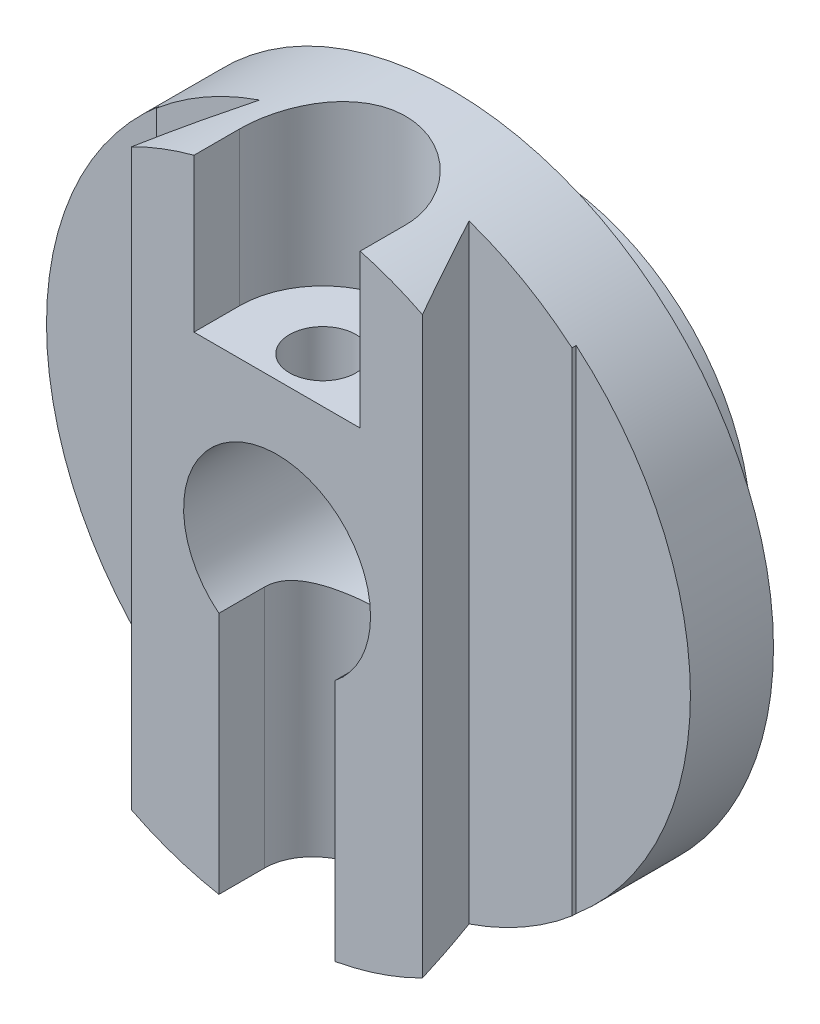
from build123d import *

# Parameters (mm, degrees)
SKETCH1_R           = 77.5
BOSS_EXTRUDE1_DEPTH = 64
SKETCH2_W           = 27.5
SKETCH2_H           = 22
CUT_EXTRUDE1_DEPTH  = 100
SKETCH3_W           = 100
SKETCH3_H           = 22
CUT_EXTRUDE2_DEPTH  = 100
SKETCH4_R           = 50
BOSS_EXTRUDE2_DEPTH = 22
HOLE1_D             = 22
HOLE1_CBORE_D       = 45
HOLE1_CBORE_DEPTH   = 42
CUT_EXTRUDE3_DEPTH  = 39.5
CUT_EXTRUDE4_START  = -77.5
CUT_EXTRUDE4_DEPTH  = 77.5
SKETCH10_R          = 8
CUT_EXTRUDE6_DEPTH  = 150


with BuildPart() as part:
    # Sketch1 → Boss-Extrude1 (new body)
    with BuildSketch(Plane.XY):
        Circle(SKETCH1_R)
    extrude(amount=BOSS_EXTRUDE1_DEPTH)

    # Sketch2 → Cut-Extrude1 (cut, symmetric)
    with BuildSketch(Plane(origin=(0, 0, 0), x_dir=(1, 0, 0), z_dir=(0, 1, 0))):
        with Locations((-63.75, -11)):
            Rectangle(SKETCH2_W, SKETCH2_H)
        Polygon((-77.5, -42), (-77.5, -64), (-35, -64), (-25.207539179, -43), (-50, -43), (-50, -42), align=None)
        Polygon((77.5, -42), (77.5, -64), (35, -64), (25.207539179, -43), (50, -43), (50, -42), align=None)
        with Locations((63.75, -11)):
            Rectangle(SKETCH2_W, SKETCH2_H)
    extrude(amount=CUT_EXTRUDE1_DEPTH, both=True, mode=Mode.SUBTRACT)

    # Sketch3 → Cut-Extrude2 (cut, symmetric)
    with BuildSketch(Plane(origin=(0, 0, 0), x_dir=(1, 0, 0), z_dir=(0, 1, 0))):
        with Locations((0, -11)):
            Rectangle(SKETCH3_W, SKETCH3_H)
    extrude(amount=CUT_EXTRUDE2_DEPTH, both=True, mode=Mode.SUBTRACT)

    # Sketch4 → Boss-Extrude2 (add)
    with BuildSketch(Plane(origin=(0, 0, 22), x_dir=(-1, 0, 0), z_dir=(0, 0, -1))):
        with Locations(Location((0, 0, 0), (0, 0, 180))):
            Circle(SKETCH4_R)
    extrude(amount=BOSS_EXTRUDE2_DEPTH)

    # Hole1 (through all)
    with Locations(Plane.XY.offset(64)):
        with Locations((0, 0)):
            CounterBoreHole(HOLE1_D / 2, HOLE1_CBORE_D / 2, HOLE1_CBORE_DEPTH)

    # Sketch8 → Cut-Extrude3 (cut)
    with BuildSketch(Plane(origin=(0, 77.5, 0), x_dir=(1, 0, 0), z_dir=(0, 1, 0))):
        with BuildLine():
            Line((-20, -64), (20, -64))
            Line((20, -64), (20, -53))
            ThreePointArc((20, -53), (0, -33), (-20, -53))
            Line((-20, -53), (-20, -64))
        make_face()
    extrude(amount=-CUT_EXTRUDE3_DEPTH, mode=Mode.SUBTRACT)

    # Sketch9 → Cut-Extrude4 (cut)
    with BuildSketch(Plane(origin=(0, 0, 0), x_dir=(1, 0, 0), z_dir=(0, 1, 0)).offset(CUT_EXTRUDE4_START)):
        with BuildLine():
            Line((-14, -64), (14, -64))
            Line((14, -64), (14, -53))
            ThreePointArc((14, -53), (0, -39), (-14, -53))
            Line((-14, -53), (-14, -64))
        make_face()
    extrude(amount=CUT_EXTRUDE4_DEPTH, mode=Mode.SUBTRACT)

    # Sketch10 → Cut-Extrude6 (cut, symmetric)
    with BuildSketch(Plane(origin=(0, 38, 0), x_dir=(1, 0, 0), z_dir=(0, 1, 0))):
        with Locations(Location((0, -53, 0), (0, 0, 270))):
            Circle(SKETCH10_R)
    extrude(amount=CUT_EXTRUDE6_DEPTH, both=True, mode=Mode.SUBTRACT)


solid = part.part
